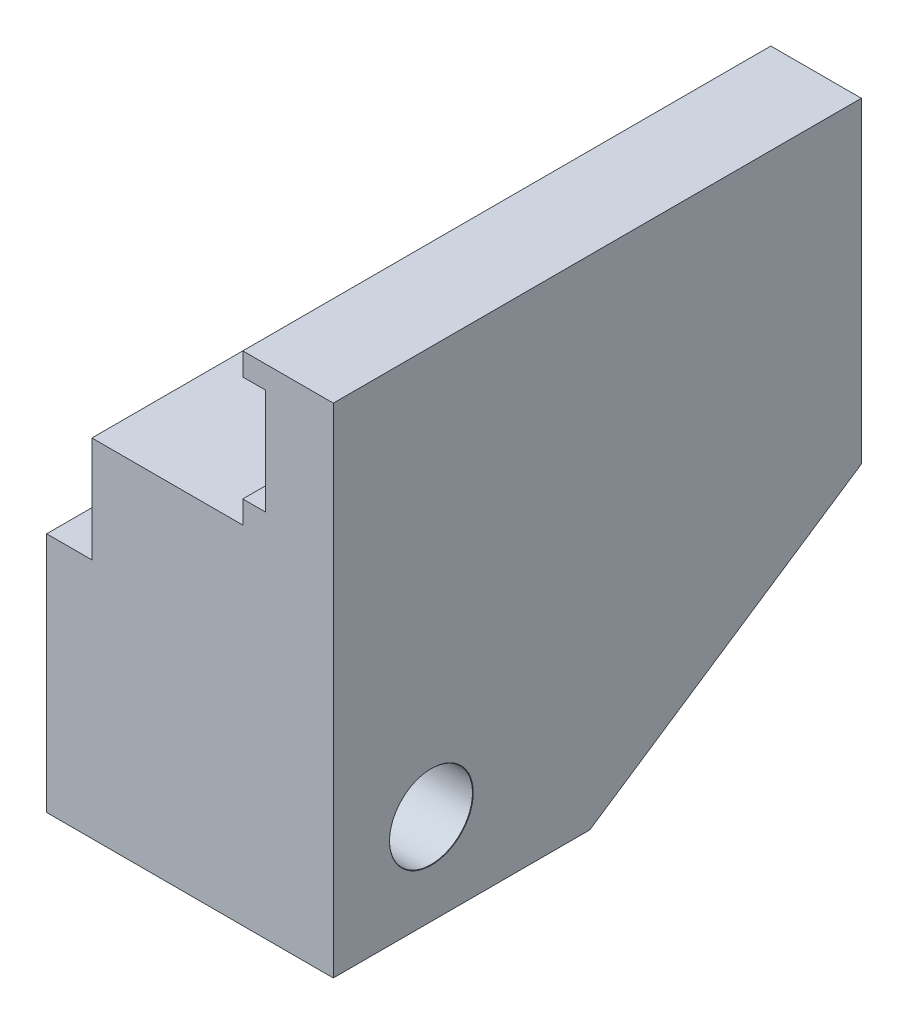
ISO-10303-21;
HEADER;
FILE_DESCRIPTION(('STEP AP214'),'2;1');
FILE_NAME('part.step','',(''),(''),'','','');
FILE_SCHEMA(('AUTOMOTIVE_DESIGN { 1 0 10303 214 1 1 1 1 }'));
ENDSEC;
DATA;
#1=APPLICATION_CONTEXT('core data for automotive mechanical design processes');
#2=APPLICATION_PROTOCOL_DEFINITION('international standard','automotive_design',2000,#1);
#3=PRODUCT_CONTEXT('',#1,'mechanical');
#4=PRODUCT('Part','Part','',(#3));
#5=PRODUCT_RELATED_PRODUCT_CATEGORY('part','',(#4));
#6=PRODUCT_DEFINITION_FORMATION('','',#4);
#7=PRODUCT_DEFINITION_CONTEXT('part definition',#1,'design');
#8=PRODUCT_DEFINITION('design','',#6,#7);
#9=PRODUCT_DEFINITION_SHAPE('','',#8);
#10=(LENGTH_UNIT() NAMED_UNIT(*) SI_UNIT(.MILLI.,.METRE.));
#11=(NAMED_UNIT(*) PLANE_ANGLE_UNIT() SI_UNIT($,.RADIAN.));
#12=(NAMED_UNIT(*) SI_UNIT($,.STERADIAN.) SOLID_ANGLE_UNIT());
#13=UNCERTAINTY_MEASURE_WITH_UNIT(LENGTH_MEASURE(1.E-05),#10,'distance_accuracy_value','');
#14=(GEOMETRIC_REPRESENTATION_CONTEXT(3) GLOBAL_UNCERTAINTY_ASSIGNED_CONTEXT((#13)) GLOBAL_UNIT_ASSIGNED_CONTEXT((#10,
#11,#12)) REPRESENTATION_CONTEXT('',''));
#15=CARTESIAN_POINT('',(0.,0.,0.));
#16=DIRECTION('',(0.,0.,1.));
#17=DIRECTION('',(1.,0.,0.));
#18=AXIS2_PLACEMENT_3D('',#15,#16,#17);
#19=CARTESIAN_POINT('',(-159.,218.05458814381,-35.));
#20=DIRECTION('',(-1.,0.,0.));
#21=DIRECTION('',(0.,0.,-1.));
#22=AXIS2_PLACEMENT_3D('',#19,#20,#21);
#23=PLANE('',#22);
#24=CARTESIAN_POINT('',(-159.,224.05458814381,-6.5));
#25=DIRECTION('',(1.,0.,0.));
#26=DIRECTION('',(0.,0.,-1.));
#27=AXIS2_PLACEMENT_3D('',#24,#25,#26);
#28=CIRCLE('',#27,2.775);
#29=CARTESIAN_POINT('',(-159.,224.05458814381,-9.275));
#30=VERTEX_POINT('',#29);
#31=EDGE_CURVE('E322',#30,#30,#28,.T.);
#32=ORIENTED_EDGE('',*,*,#31,.F.);
#33=EDGE_LOOP('',(#32));
#34=FACE_BOUND('',#33,.T.);
#35=DIRECTION('',(0.,0.,1.));
#36=VECTOR('',#35,1.);
#37=CARTESIAN_POINT('',(-159.,218.05458814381,-35.));
#38=LINE('',#37,#36);
#39=CARTESIAN_POINT('',(-159.,218.05458814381,-17.));
#40=VERTEX_POINT('',#39);
#41=CARTESIAN_POINT('',(-159.,218.05458814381,0.));
#42=VERTEX_POINT('',#41);
#43=EDGE_CURVE('E191',#40,#42,#38,.T.);
#44=ORIENTED_EDGE('',*,*,#43,.F.);
#45=DIRECTION('',(0.,0.554700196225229,-0.832050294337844));
#46=VECTOR('',#45,1.);
#47=CARTESIAN_POINT('',(-159.,218.05458814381,-17.));
#48=LINE('',#47,#46);
#49=CARTESIAN_POINT('',(-159.,230.05458814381,-35.));
#50=VERTEX_POINT('',#49);
#51=EDGE_CURVE('E38',#40,#50,#48,.T.);
#52=ORIENTED_EDGE('',*,*,#51,.T.);
#53=DIRECTION('',(0.,1.,0.));
#54=VECTOR('',#53,1.);
#55=CARTESIAN_POINT('',(-159.,218.05458814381,-35.));
#56=LINE('',#55,#54);
#57=CARTESIAN_POINT('',(-159.,251.054588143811,-35.));
#58=VERTEX_POINT('',#57);
#59=EDGE_CURVE('E181',#50,#58,#56,.T.);
#60=ORIENTED_EDGE('',*,*,#59,.T.);
#61=DIRECTION('',(0.,0.,1.));
#62=VECTOR('',#61,1.);
#63=CARTESIAN_POINT('',(-159.,251.054588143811,-35.));
#64=LINE('',#63,#62);
#65=CARTESIAN_POINT('',(-159.,251.054588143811,0.));
#66=VERTEX_POINT('',#65);
#67=EDGE_CURVE('E211',#58,#66,#64,.T.);
#68=ORIENTED_EDGE('',*,*,#67,.T.);
#69=DIRECTION('',(0.,1.,0.));
#70=VECTOR('',#69,1.);
#71=CARTESIAN_POINT('',(-159.,218.05458814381,0.));
#72=LINE('',#71,#70);
#73=EDGE_CURVE('E172',#42,#66,#72,.T.);
#74=ORIENTED_EDGE('',*,*,#73,.F.);
#75=EDGE_LOOP('',(#44,#52,#60,#68,#74));
#76=FACE_BOUND('',#75,.T.);
#77=ADVANCED_FACE('F16',(#34,#76),#23,.F.);
#78=CARTESIAN_POINT('',(-159.,251.054588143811,-35.));
#79=DIRECTION('',(0.,-1.,0.));
#80=DIRECTION('',(0.,0.,1.));
#81=AXIS2_PLACEMENT_3D('',#78,#79,#80);
#82=PLANE('',#81);
#83=DIRECTION('',(-1.,0.,0.));
#84=VECTOR('',#83,1.);
#85=CARTESIAN_POINT('',(-159.,251.054588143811,0.));
#86=LINE('',#85,#84);
#87=CARTESIAN_POINT('',(-165.,251.054588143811,0.));
#88=VERTEX_POINT('',#87);
#89=EDGE_CURVE('E194',#66,#88,#86,.T.);
#90=ORIENTED_EDGE('',*,*,#89,.F.);
#91=ORIENTED_EDGE('',*,*,#67,.F.);
#92=DIRECTION('',(-1.,0.,0.));
#93=VECTOR('',#92,1.);
#94=CARTESIAN_POINT('',(-159.,251.054588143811,-35.));
#95=LINE('',#94,#93);
#96=CARTESIAN_POINT('',(-165.,251.054588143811,-35.));
#97=VERTEX_POINT('',#96);
#98=EDGE_CURVE('E183',#58,#97,#95,.T.);
#99=ORIENTED_EDGE('',*,*,#98,.T.);
#100=DIRECTION('',(0.,0.,1.));
#101=VECTOR('',#100,1.);
#102=CARTESIAN_POINT('',(-165.,251.054588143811,-35.));
#103=LINE('',#102,#101);
#104=EDGE_CURVE('E208',#97,#88,#103,.T.);
#105=ORIENTED_EDGE('',*,*,#104,.T.);
#106=EDGE_LOOP('',(#90,#91,#99,#105));
#107=FACE_BOUND('',#106,.T.);
#108=ADVANCED_FACE('F242',(#107),#82,.F.);
#109=CARTESIAN_POINT('',(-165.,251.054588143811,-35.));
#110=DIRECTION('',(1.,0.,0.));
#111=DIRECTION('',(0.,0.,1.));
#112=AXIS2_PLACEMENT_3D('',#109,#110,#111);
#113=PLANE('',#112);
#114=DIRECTION('',(0.,-1.,0.));
#115=VECTOR('',#114,1.);
#116=CARTESIAN_POINT('',(-165.,251.054588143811,0.));
#117=LINE('',#116,#115);
#118=CARTESIAN_POINT('',(-165.,249.55458814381,0.));
#119=VERTEX_POINT('',#118);
#120=EDGE_CURVE('E197',#88,#119,#117,.T.);
#121=ORIENTED_EDGE('',*,*,#120,.F.);
#122=ORIENTED_EDGE('',*,*,#104,.F.);
#123=DIRECTION('',(0.,-1.,0.));
#124=VECTOR('',#123,1.);
#125=CARTESIAN_POINT('',(-165.,251.054588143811,-35.));
#126=LINE('',#125,#124);
#127=CARTESIAN_POINT('',(-165.,249.55458814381,-35.));
#128=VERTEX_POINT('',#127);
#129=EDGE_CURVE('E187',#97,#128,#126,.T.);
#130=ORIENTED_EDGE('',*,*,#129,.T.);
#131=DIRECTION('',(0.,0.,1.));
#132=VECTOR('',#131,1.);
#133=CARTESIAN_POINT('',(-165.,249.55458814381,-35.));
#134=LINE('',#133,#132);
#135=EDGE_CURVE('E156',#128,#119,#134,.T.);
#136=ORIENTED_EDGE('',*,*,#135,.T.);
#137=EDGE_LOOP('',(#121,#122,#130,#136));
#138=FACE_BOUND('',#137,.T.);
#139=ADVANCED_FACE('F248',(#138),#113,.F.);
#140=CARTESIAN_POINT('',(-178.,218.05458814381,-35.));
#141=DIRECTION('',(1.,0.,0.));
#142=DIRECTION('',(0.,0.,1.));
#143=AXIS2_PLACEMENT_3D('',#140,#141,#142);
#144=PLANE('',#143);
#145=CARTESIAN_POINT('',(-178.,224.05458814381,-6.5));
#146=DIRECTION('',(1.,0.,0.));
#147=DIRECTION('',(0.,0.,-1.));
#148=AXIS2_PLACEMENT_3D('',#145,#146,#147);
#149=CIRCLE('',#148,5.025);
#150=CARTESIAN_POINT('',(-178.,224.05458814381,-11.525));
#151=VERTEX_POINT('',#150);
#152=EDGE_CURVE('E317',#151,#151,#149,.T.);
#153=ORIENTED_EDGE('',*,*,#152,.T.);
#154=EDGE_LOOP('',(#153));
#155=FACE_BOUND('',#154,.T.);
#156=DIRECTION('',(0.,-1.,0.));
#157=VECTOR('',#156,1.);
#158=CARTESIAN_POINT('',(-178.,218.05458814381,-35.));
#159=LINE('',#158,#157);
#160=CARTESIAN_POINT('',(-178.,234.05458814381,-35.));
#161=VERTEX_POINT('',#160);
#162=CARTESIAN_POINT('',(-178.,230.05458814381,-35.));
#163=VERTEX_POINT('',#162);
#164=EDGE_CURVE('E130',#161,#163,#159,.T.);
#165=ORIENTED_EDGE('',*,*,#164,.T.);
#166=DIRECTION('',(0.,-0.554700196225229,0.832050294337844));
#167=VECTOR('',#166,1.);
#168=CARTESIAN_POINT('',(-178.,218.05458814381,-17.));
#169=LINE('',#168,#167);
#170=CARTESIAN_POINT('',(-178.,218.05458814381,-17.));
#171=VERTEX_POINT('',#170);
#172=EDGE_CURVE('E11',#163,#171,#169,.T.);
#173=ORIENTED_EDGE('',*,*,#172,.T.);
#174=DIRECTION('',(0.,0.,1.));
#175=VECTOR('',#174,1.);
#176=CARTESIAN_POINT('',(-178.,218.05458814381,-35.));
#177=LINE('',#176,#175);
#178=CARTESIAN_POINT('',(-178.,218.05458814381,0.));
#179=VERTEX_POINT('',#178);
#180=EDGE_CURVE('E206',#171,#179,#177,.T.);
#181=ORIENTED_EDGE('',*,*,#180,.T.);
#182=DIRECTION('',(0.,-1.,0.));
#183=VECTOR('',#182,1.);
#184=CARTESIAN_POINT('',(-178.,218.05458814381,0.));
#185=LINE('',#184,#183);
#186=CARTESIAN_POINT('',(-178.,234.05458814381,0.));
#187=VERTEX_POINT('',#186);
#188=EDGE_CURVE('E200',#187,#179,#185,.T.);
#189=ORIENTED_EDGE('',*,*,#188,.F.);
#190=DIRECTION('',(0.,0.,1.));
#191=VECTOR('',#190,1.);
#192=CARTESIAN_POINT('',(-178.,234.05458814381,-35.));
#193=LINE('',#192,#191);
#194=EDGE_CURVE('E120',#161,#187,#193,.T.);
#195=ORIENTED_EDGE('',*,*,#194,.F.);
#196=EDGE_LOOP('',(#165,#173,#181,#189,#195));
#197=FACE_BOUND('',#196,.T.);
#198=ADVANCED_FACE('F230',(#155,#197),#144,.F.);
#199=CARTESIAN_POINT('',(-159.,218.05458814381,-35.));
#200=DIRECTION('',(0.,1.,0.));
#201=DIRECTION('',(0.,0.,-1.));
#202=AXIS2_PLACEMENT_3D('',#199,#200,#201);
#203=PLANE('',#202);
#204=ORIENTED_EDGE('',*,*,#180,.F.);
#205=DIRECTION('',(1.,0.,0.));
#206=VECTOR('',#205,1.);
#207=CARTESIAN_POINT('',(-159.,218.05458814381,-17.));
#208=LINE('',#207,#206);
#209=EDGE_CURVE('E214',#171,#40,#208,.T.);
#210=ORIENTED_EDGE('',*,*,#209,.T.);
#211=ORIENTED_EDGE('',*,*,#43,.T.);
#212=DIRECTION('',(1.,0.,0.));
#213=VECTOR('',#212,1.);
#214=CARTESIAN_POINT('',(-159.,218.05458814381,0.));
#215=LINE('',#214,#213);
#216=EDGE_CURVE('E184',#179,#42,#215,.T.);
#217=ORIENTED_EDGE('',*,*,#216,.F.);
#218=EDGE_LOOP('',(#204,#210,#211,#217));
#219=FACE_BOUND('',#218,.T.);
#220=ADVANCED_FACE('F220',(#219),#203,.F.);
#221=CARTESIAN_POINT('',(0.,0.,-35.));
#222=DIRECTION('',(0.,0.,-1.));
#223=DIRECTION('',(1.,0.,0.));
#224=AXIS2_PLACEMENT_3D('',#221,#222,#223);
#225=PLANE('',#224);
#226=ORIENTED_EDGE('',*,*,#59,.F.);
#227=DIRECTION('',(-1.,0.,0.));
#228=VECTOR('',#227,1.);
#229=CARTESIAN_POINT('',(-178.,230.05458814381,-35.));
#230=LINE('',#229,#228);
#231=EDGE_CURVE('E24',#50,#163,#230,.T.);
#232=ORIENTED_EDGE('',*,*,#231,.T.);
#233=ORIENTED_EDGE('',*,*,#164,.F.);
#234=DIRECTION('',(-1.,0.,0.));
#235=VECTOR('',#234,1.);
#236=CARTESIAN_POINT('',(-178.,234.05458814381,-35.));
#237=LINE('',#236,#235);
#238=CARTESIAN_POINT('',(-175.,234.05458814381,-35.));
#239=VERTEX_POINT('',#238);
#240=EDGE_CURVE('E114',#239,#161,#237,.T.);
#241=ORIENTED_EDGE('',*,*,#240,.F.);
#242=DIRECTION('',(0.,-1.,0.));
#243=VECTOR('',#242,1.);
#244=CARTESIAN_POINT('',(-175.,234.05458814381,-35.));
#245=LINE('',#244,#243);
#246=CARTESIAN_POINT('',(-175.,241.05458814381,-35.));
#247=VERTEX_POINT('',#246);
#248=EDGE_CURVE('E124',#247,#239,#245,.T.);
#249=ORIENTED_EDGE('',*,*,#248,.F.);
#250=DIRECTION('',(-1.,0.,0.));
#251=VECTOR('',#250,1.);
#252=CARTESIAN_POINT('',(-178.,241.05458814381,-35.));
#253=LINE('',#252,#251);
#254=CARTESIAN_POINT('',(-165.,241.05458814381,-35.));
#255=VERTEX_POINT('',#254);
#256=EDGE_CURVE('E154',#255,#247,#253,.T.);
#257=ORIENTED_EDGE('',*,*,#256,.F.);
#258=DIRECTION('',(0.,-1.,0.));
#259=VECTOR('',#258,1.);
#260=CARTESIAN_POINT('',(-165.,242.55458814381,-35.));
#261=LINE('',#260,#259);
#262=CARTESIAN_POINT('',(-165.,242.55458814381,-35.));
#263=VERTEX_POINT('',#262);
#264=EDGE_CURVE('E151',#263,#255,#261,.T.);
#265=ORIENTED_EDGE('',*,*,#264,.F.);
#266=DIRECTION('',(-1.,0.,0.));
#267=VECTOR('',#266,1.);
#268=CARTESIAN_POINT('',(-163.5,242.55458814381,-35.));
#269=LINE('',#268,#267);
#270=CARTESIAN_POINT('',(-163.5,242.55458814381,-35.));
#271=VERTEX_POINT('',#270);
#272=EDGE_CURVE('E148',#271,#263,#269,.T.);
#273=ORIENTED_EDGE('',*,*,#272,.F.);
#274=DIRECTION('',(0.,-1.,0.));
#275=VECTOR('',#274,1.);
#276=CARTESIAN_POINT('',(-163.5,242.55458814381,-35.));
#277=LINE('',#276,#275);
#278=CARTESIAN_POINT('',(-163.5,249.55458814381,-35.));
#279=VERTEX_POINT('',#278);
#280=EDGE_CURVE('E144',#279,#271,#277,.T.);
#281=ORIENTED_EDGE('',*,*,#280,.F.);
#282=DIRECTION('',(1.,0.,0.));
#283=VECTOR('',#282,1.);
#284=CARTESIAN_POINT('',(-163.5,249.55458814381,-35.));
#285=LINE('',#284,#283);
#286=EDGE_CURVE('E141',#128,#279,#285,.T.);
#287=ORIENTED_EDGE('',*,*,#286,.F.);
#288=ORIENTED_EDGE('',*,*,#129,.F.);
#289=ORIENTED_EDGE('',*,*,#98,.F.);
#290=EDGE_LOOP('',(#226,#232,#233,#241,#249,#257,#265,#273,#281,#287,#288,#289));
#291=FACE_BOUND('',#290,.T.);
#292=ADVANCED_FACE('F129',(#291),#225,.T.);
#293=CARTESIAN_POINT('',(0.,0.,0.));
#294=DIRECTION('',(0.,0.,-1.));
#295=DIRECTION('',(1.,0.,0.));
#296=AXIS2_PLACEMENT_3D('',#293,#294,#295);
#297=PLANE('',#296);
#298=ORIENTED_EDGE('',*,*,#188,.T.);
#299=ORIENTED_EDGE('',*,*,#216,.T.);
#300=ORIENTED_EDGE('',*,*,#73,.T.);
#301=ORIENTED_EDGE('',*,*,#89,.T.);
#302=ORIENTED_EDGE('',*,*,#120,.T.);
#303=DIRECTION('',(1.,0.,0.));
#304=VECTOR('',#303,1.);
#305=CARTESIAN_POINT('',(-163.5,249.55458814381,0.));
#306=LINE('',#305,#304);
#307=CARTESIAN_POINT('',(-163.5,249.55458814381,0.));
#308=VERTEX_POINT('',#307);
#309=EDGE_CURVE('E139',#119,#308,#306,.T.);
#310=ORIENTED_EDGE('',*,*,#309,.T.);
#311=DIRECTION('',(0.,-1.,0.));
#312=VECTOR('',#311,1.);
#313=CARTESIAN_POINT('',(-163.5,242.55458814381,0.));
#314=LINE('',#313,#312);
#315=CARTESIAN_POINT('',(-163.5,242.55458814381,0.));
#316=VERTEX_POINT('',#315);
#317=EDGE_CURVE('E159',#308,#316,#314,.T.);
#318=ORIENTED_EDGE('',*,*,#317,.T.);
#319=DIRECTION('',(-1.,0.,0.));
#320=VECTOR('',#319,1.);
#321=CARTESIAN_POINT('',(-163.5,242.55458814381,0.));
#322=LINE('',#321,#320);
#323=CARTESIAN_POINT('',(-165.,242.55458814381,0.));
#324=VERTEX_POINT('',#323);
#325=EDGE_CURVE('E162',#316,#324,#322,.T.);
#326=ORIENTED_EDGE('',*,*,#325,.T.);
#327=DIRECTION('',(0.,-1.,0.));
#328=VECTOR('',#327,1.);
#329=CARTESIAN_POINT('',(-165.,242.55458814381,0.));
#330=LINE('',#329,#328);
#331=CARTESIAN_POINT('',(-165.,241.05458814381,0.));
#332=VERTEX_POINT('',#331);
#333=EDGE_CURVE('E165',#324,#332,#330,.T.);
#334=ORIENTED_EDGE('',*,*,#333,.T.);
#335=DIRECTION('',(-1.,0.,0.));
#336=VECTOR('',#335,1.);
#337=CARTESIAN_POINT('',(-178.,241.05458814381,0.));
#338=LINE('',#337,#336);
#339=CARTESIAN_POINT('',(-175.,241.05458814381,0.));
#340=VERTEX_POINT('',#339);
#341=EDGE_CURVE('E145',#332,#340,#338,.T.);
#342=ORIENTED_EDGE('',*,*,#341,.T.);
#343=DIRECTION('',(0.,-1.,0.));
#344=VECTOR('',#343,1.);
#345=CARTESIAN_POINT('',(-175.,234.05458814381,0.));
#346=LINE('',#345,#344);
#347=CARTESIAN_POINT('',(-175.,234.05458814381,0.));
#348=VERTEX_POINT('',#347);
#349=EDGE_CURVE('E135',#340,#348,#346,.T.);
#350=ORIENTED_EDGE('',*,*,#349,.T.);
#351=DIRECTION('',(-1.,0.,0.));
#352=VECTOR('',#351,1.);
#353=CARTESIAN_POINT('',(-178.,234.05458814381,0.));
#354=LINE('',#353,#352);
#355=EDGE_CURVE('E116',#348,#187,#354,.T.);
#356=ORIENTED_EDGE('',*,*,#355,.T.);
#357=EDGE_LOOP('',(#298,#299,#300,#301,#302,#310,#318,#326,#334,#342,#350,#356));
#358=FACE_BOUND('',#357,.T.);
#359=ADVANCED_FACE('F227',(#358),#297,.F.);
#360=CARTESIAN_POINT('',(-178.,241.05458814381,-35.));
#361=DIRECTION('',(0.,-1.,0.));
#362=DIRECTION('',(0.,0.,1.));
#363=AXIS2_PLACEMENT_3D('',#360,#361,#362);
#364=PLANE('',#363);
#365=ORIENTED_EDGE('',*,*,#341,.F.);
#366=DIRECTION('',(0.,0.,1.));
#367=VECTOR('',#366,1.);
#368=CARTESIAN_POINT('',(-165.,241.05458814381,-35.));
#369=LINE('',#368,#367);
#370=EDGE_CURVE('E170',#255,#332,#369,.T.);
#371=ORIENTED_EDGE('',*,*,#370,.F.);
#372=ORIENTED_EDGE('',*,*,#256,.T.);
#373=DIRECTION('',(0.,0.,1.));
#374=VECTOR('',#373,1.);
#375=CARTESIAN_POINT('',(-175.,241.05458814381,-35.));
#376=LINE('',#375,#374);
#377=EDGE_CURVE('E121',#247,#340,#376,.T.);
#378=ORIENTED_EDGE('',*,*,#377,.T.);
#379=EDGE_LOOP('',(#365,#371,#372,#378));
#380=FACE_BOUND('',#379,.T.);
#381=ADVANCED_FACE('F263',(#380),#364,.F.);
#382=CARTESIAN_POINT('',(-165.,242.55458814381,-35.));
#383=DIRECTION('',(1.,0.,0.));
#384=DIRECTION('',(0.,0.,1.));
#385=AXIS2_PLACEMENT_3D('',#382,#383,#384);
#386=PLANE('',#385);
#387=ORIENTED_EDGE('',*,*,#333,.F.);
#388=DIRECTION('',(0.,0.,1.));
#389=VECTOR('',#388,1.);
#390=CARTESIAN_POINT('',(-165.,242.55458814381,-35.));
#391=LINE('',#390,#389);
#392=EDGE_CURVE('E173',#263,#324,#391,.T.);
#393=ORIENTED_EDGE('',*,*,#392,.F.);
#394=ORIENTED_EDGE('',*,*,#264,.T.);
#395=ORIENTED_EDGE('',*,*,#370,.T.);
#396=EDGE_LOOP('',(#387,#393,#394,#395));
#397=FACE_BOUND('',#396,.T.);
#398=ADVANCED_FACE('F277',(#397),#386,.F.);
#399=CARTESIAN_POINT('',(-163.5,242.55458814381,-35.));
#400=DIRECTION('',(0.,-1.,0.));
#401=DIRECTION('',(0.,0.,1.));
#402=AXIS2_PLACEMENT_3D('',#399,#400,#401);
#403=PLANE('',#402);
#404=ORIENTED_EDGE('',*,*,#325,.F.);
#405=DIRECTION('',(0.,0.,1.));
#406=VECTOR('',#405,1.);
#407=CARTESIAN_POINT('',(-163.5,242.55458814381,-35.));
#408=LINE('',#407,#406);
#409=EDGE_CURVE('E175',#271,#316,#408,.T.);
#410=ORIENTED_EDGE('',*,*,#409,.F.);
#411=ORIENTED_EDGE('',*,*,#272,.T.);
#412=ORIENTED_EDGE('',*,*,#392,.T.);
#413=EDGE_LOOP('',(#404,#410,#411,#412));
#414=FACE_BOUND('',#413,.T.);
#415=ADVANCED_FACE('F273',(#414),#403,.F.);
#416=CARTESIAN_POINT('',(-163.5,242.55458814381,-35.));
#417=DIRECTION('',(1.,0.,0.));
#418=DIRECTION('',(0.,0.,1.));
#419=AXIS2_PLACEMENT_3D('',#416,#417,#418);
#420=PLANE('',#419);
#421=ORIENTED_EDGE('',*,*,#317,.F.);
#422=DIRECTION('',(0.,0.,1.));
#423=VECTOR('',#422,1.);
#424=CARTESIAN_POINT('',(-163.5,249.55458814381,-35.));
#425=LINE('',#424,#423);
#426=EDGE_CURVE('E177',#279,#308,#425,.T.);
#427=ORIENTED_EDGE('',*,*,#426,.F.);
#428=ORIENTED_EDGE('',*,*,#280,.T.);
#429=ORIENTED_EDGE('',*,*,#409,.T.);
#430=EDGE_LOOP('',(#421,#427,#428,#429));
#431=FACE_BOUND('',#430,.T.);
#432=ADVANCED_FACE('F269',(#431),#420,.F.);
#433=CARTESIAN_POINT('',(-163.5,249.55458814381,-35.));
#434=DIRECTION('',(0.,1.,0.));
#435=DIRECTION('',(0.,0.,-1.));
#436=AXIS2_PLACEMENT_3D('',#433,#434,#435);
#437=PLANE('',#436);
#438=ORIENTED_EDGE('',*,*,#309,.F.);
#439=ORIENTED_EDGE('',*,*,#135,.F.);
#440=ORIENTED_EDGE('',*,*,#286,.T.);
#441=ORIENTED_EDGE('',*,*,#426,.T.);
#442=EDGE_LOOP('',(#438,#439,#440,#441));
#443=FACE_BOUND('',#442,.T.);
#444=ADVANCED_FACE('F266',(#443),#437,.F.);
#445=CARTESIAN_POINT('',(-178.,234.05458814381,-35.));
#446=DIRECTION('',(0.,-1.,0.));
#447=DIRECTION('',(0.,0.,1.));
#448=AXIS2_PLACEMENT_3D('',#445,#446,#447);
#449=PLANE('',#448);
#450=ORIENTED_EDGE('',*,*,#355,.F.);
#451=DIRECTION('',(0.,0.,1.));
#452=VECTOR('',#451,1.);
#453=CARTESIAN_POINT('',(-175.,234.05458814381,-35.));
#454=LINE('',#453,#452);
#455=EDGE_CURVE('E109',#239,#348,#454,.T.);
#456=ORIENTED_EDGE('',*,*,#455,.F.);
#457=ORIENTED_EDGE('',*,*,#240,.T.);
#458=ORIENTED_EDGE('',*,*,#194,.T.);
#459=EDGE_LOOP('',(#450,#456,#457,#458));
#460=FACE_BOUND('',#459,.T.);
#461=ADVANCED_FACE('F111',(#460),#449,.F.);
#462=CARTESIAN_POINT('',(-175.,234.05458814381,-35.));
#463=DIRECTION('',(1.,0.,0.));
#464=DIRECTION('',(0.,0.,1.));
#465=AXIS2_PLACEMENT_3D('',#462,#463,#464);
#466=PLANE('',#465);
#467=ORIENTED_EDGE('',*,*,#349,.F.);
#468=ORIENTED_EDGE('',*,*,#377,.F.);
#469=ORIENTED_EDGE('',*,*,#248,.T.);
#470=ORIENTED_EDGE('',*,*,#455,.T.);
#471=EDGE_LOOP('',(#467,#468,#469,#470));
#472=FACE_BOUND('',#471,.T.);
#473=ADVANCED_FACE('F125',(#472),#466,.F.);
#474=CARTESIAN_POINT('',(-159.025,224.05458814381,-6.5));
#475=DIRECTION('',(1.,0.,0.));
#476=DIRECTION('',(0.,0.,1.));
#477=AXIS2_PLACEMENT_3D('',#474,#475,#476);
#478=CONICAL_SURFACE('',#477,2.75,0.785398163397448);
#479=ORIENTED_EDGE('',*,*,#31,.T.);
#480=EDGE_LOOP('',(#479));
#481=FACE_BOUND('',#480,.T.);
#482=CARTESIAN_POINT('',(-159.025,224.05458814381,-6.5));
#483=DIRECTION('',(1.,0.,0.));
#484=DIRECTION('',(0.,0.,-1.));
#485=AXIS2_PLACEMENT_3D('',#482,#483,#484);
#486=CIRCLE('',#485,2.75);
#487=CARTESIAN_POINT('',(-159.025,224.05458814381,-9.25));
#488=VERTEX_POINT('',#487);
#489=EDGE_CURVE('E137',#488,#488,#486,.T.);
#490=ORIENTED_EDGE('',*,*,#489,.F.);
#491=EDGE_LOOP('',(#490));
#492=FACE_BOUND('',#491,.T.);
#493=ADVANCED_FACE('F287',(#481,#492),#478,.F.);
#494=CARTESIAN_POINT('',(-178.,224.05458814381,-6.5));
#495=DIRECTION('',(-1.,0.,0.));
#496=DIRECTION('',(0.,0.,-1.));
#497=AXIS2_PLACEMENT_3D('',#494,#495,#496);
#498=CYLINDRICAL_SURFACE('',#497,2.75);
#499=ORIENTED_EDGE('',*,*,#489,.T.);
#500=EDGE_LOOP('',(#499));
#501=FACE_BOUND('',#500,.T.);
#502=CARTESIAN_POINT('',(-172.275,224.05458814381,-6.5));
#503=DIRECTION('',(1.,0.,0.));
#504=DIRECTION('',(0.,0.,-1.));
#505=AXIS2_PLACEMENT_3D('',#502,#503,#504);
#506=CIRCLE('',#505,2.75);
#507=CARTESIAN_POINT('',(-172.275,224.05458814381,-9.25));
#508=VERTEX_POINT('',#507);
#509=EDGE_CURVE('E328',#508,#508,#506,.T.);
#510=ORIENTED_EDGE('',*,*,#509,.F.);
#511=EDGE_LOOP('',(#510));
#512=FACE_BOUND('',#511,.T.);
#513=ADVANCED_FACE('F292',(#501,#512),#498,.F.);
#514=CARTESIAN_POINT('',(-172.3,224.05458814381,-6.5));
#515=DIRECTION('',(-1.,0.,0.));
#516=DIRECTION('',(0.,0.,-1.));
#517=AXIS2_PLACEMENT_3D('',#514,#515,#516);
#518=CONICAL_SURFACE('',#517,2.775,0.785398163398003);
#519=ORIENTED_EDGE('',*,*,#509,.T.);
#520=EDGE_LOOP('',(#519));
#521=FACE_BOUND('',#520,.T.);
#522=CARTESIAN_POINT('',(-172.3,224.05458814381,-6.5));
#523=DIRECTION('',(1.,0.,0.));
#524=DIRECTION('',(0.,0.,-1.));
#525=AXIS2_PLACEMENT_3D('',#522,#523,#524);
#526=CIRCLE('',#525,2.775);
#527=CARTESIAN_POINT('',(-172.3,224.05458814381,-9.275));
#528=VERTEX_POINT('',#527);
#529=EDGE_CURVE('E319',#528,#528,#526,.T.);
#530=ORIENTED_EDGE('',*,*,#529,.F.);
#531=EDGE_LOOP('',(#530));
#532=FACE_BOUND('',#531,.T.);
#533=ADVANCED_FACE('F296',(#521,#532),#518,.F.);
#534=CARTESIAN_POINT('',(-172.3,226.82958814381,-6.5));
#535=DIRECTION('',(1.,0.,0.));
#536=DIRECTION('',(0.,0.,1.));
#537=AXIS2_PLACEMENT_3D('',#534,#535,#536);
#538=PLANE('',#537);
#539=ORIENTED_EDGE('',*,*,#529,.T.);
#540=EDGE_LOOP('',(#539));
#541=FACE_BOUND('',#540,.T.);
#542=CARTESIAN_POINT('',(-172.3,224.05458814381,-6.5));
#543=DIRECTION('',(1.,0.,0.));
#544=DIRECTION('',(0.,0.,-1.));
#545=AXIS2_PLACEMENT_3D('',#542,#543,#544);
#546=CIRCLE('',#545,5.);
#547=CARTESIAN_POINT('',(-172.3,224.05458814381,-11.5));
#548=VERTEX_POINT('',#547);
#549=EDGE_CURVE('E313',#548,#548,#546,.T.);
#550=ORIENTED_EDGE('',*,*,#549,.F.);
#551=EDGE_LOOP('',(#550));
#552=FACE_BOUND('',#551,.T.);
#553=ADVANCED_FACE('F300',(#541,#552),#538,.F.);
#554=CARTESIAN_POINT('',(-178.,224.05458814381,-6.5));
#555=DIRECTION('',(-1.,0.,0.));
#556=DIRECTION('',(0.,0.,-1.));
#557=AXIS2_PLACEMENT_3D('',#554,#555,#556);
#558=CYLINDRICAL_SURFACE('',#557,5.);
#559=ORIENTED_EDGE('',*,*,#549,.T.);
#560=EDGE_LOOP('',(#559));
#561=FACE_BOUND('',#560,.T.);
#562=CARTESIAN_POINT('',(-177.975,224.05458814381,-6.5));
#563=DIRECTION('',(1.,0.,0.));
#564=DIRECTION('',(0.,0.,-1.));
#565=AXIS2_PLACEMENT_3D('',#562,#563,#564);
#566=CIRCLE('',#565,5.);
#567=CARTESIAN_POINT('',(-177.975,224.05458814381,-11.5));
#568=VERTEX_POINT('',#567);
#569=EDGE_CURVE('E316',#568,#568,#566,.T.);
#570=ORIENTED_EDGE('',*,*,#569,.F.);
#571=EDGE_LOOP('',(#570));
#572=FACE_BOUND('',#571,.T.);
#573=ADVANCED_FACE('F238',(#561,#572),#558,.F.);
#574=CARTESIAN_POINT('',(-178.,224.05458814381,-6.5));
#575=DIRECTION('',(-1.,0.,0.));
#576=DIRECTION('',(0.,0.,-1.));
#577=AXIS2_PLACEMENT_3D('',#574,#575,#576);
#578=CONICAL_SURFACE('',#577,5.025,0.785398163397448);
#579=ORIENTED_EDGE('',*,*,#569,.T.);
#580=EDGE_LOOP('',(#579));
#581=FACE_BOUND('',#580,.T.);
#582=ORIENTED_EDGE('',*,*,#152,.F.);
#583=EDGE_LOOP('',(#582));
#584=FACE_BOUND('',#583,.T.);
#585=ADVANCED_FACE('F232',(#581,#584),#578,.F.);
#586=CARTESIAN_POINT('',(-159.,218.05458814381,-17.));
#587=DIRECTION('',(0.,-0.832050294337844,-0.554700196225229));
#588=DIRECTION('',(-1.,0.,0.));
#589=AXIS2_PLACEMENT_3D('',#586,#587,#588);
#590=PLANE('',#589);
#591=ORIENTED_EDGE('',*,*,#172,.F.);
#592=ORIENTED_EDGE('',*,*,#231,.F.);
#593=ORIENTED_EDGE('',*,*,#51,.F.);
#594=ORIENTED_EDGE('',*,*,#209,.F.);
#595=EDGE_LOOP('',(#591,#592,#593,#594));
#596=FACE_BOUND('',#595,.T.);
#597=ADVANCED_FACE('F18',(#596),#590,.T.);
#598=CLOSED_SHELL('',(#77,#108,#139,#198,#220,#292,#359,#381,#398,#415,#432,#444,#461,#473,#493,
#513,#533,#553,#573,#585,#597));
#599=MANIFOLD_SOLID_BREP('B1',#598);
#600=ADVANCED_BREP_SHAPE_REPRESENTATION('',(#18,#599),#14);
#601=SHAPE_DEFINITION_REPRESENTATION(#9,#600);
ENDSEC;
END-ISO-10303-21;
